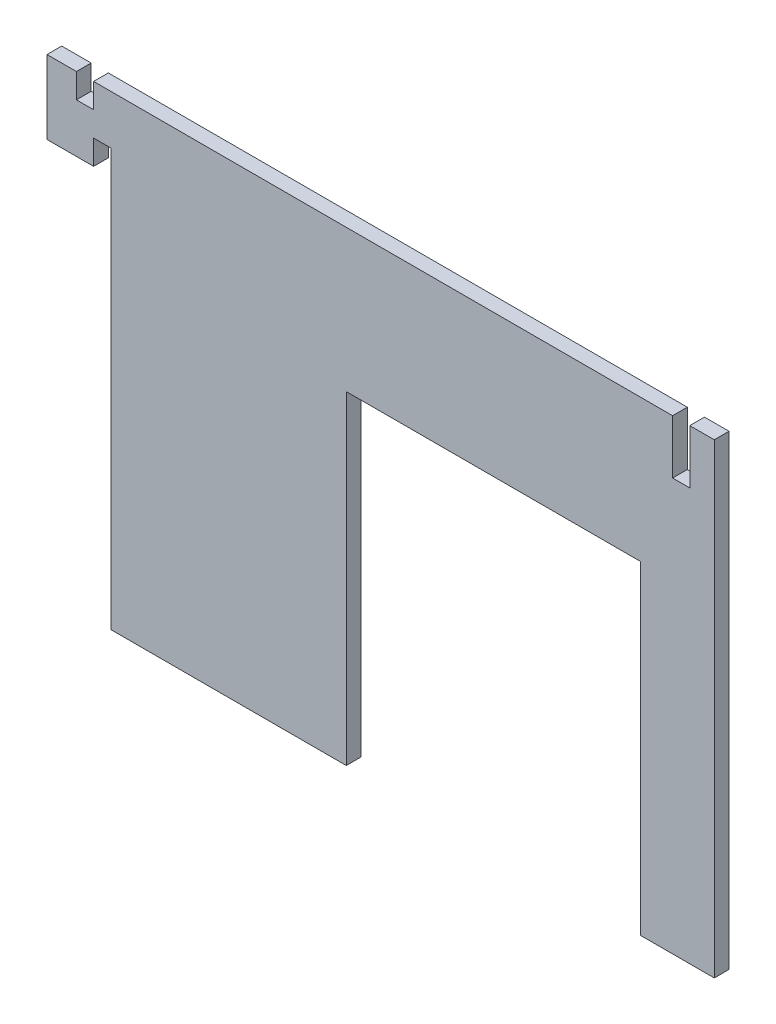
from build123d import *

# Parameters (mm, degrees)
ESQUISSE1_W             = 136
ESQUISSE1_H             = 95
EXTRUSION1_DEPTH        = 3
ESQUISSE2_W             = 13
ESQUISSE2_H             = 80
ENL_V_MAT_EXTRU_2_DEPTH = 3
ESQUISSE4_W             = 60
ESQUISSE4_H             = 66
ENL_V_MAT_EXTRU_3_DEPTH = 3
ESQUISSE5_W             = 3.5
ESQUISSE5_H             = 5
ENL_V_MAT_EXTRU_4_DEPTH = 3
ESQUISSE6_W             = 3.5
ESQUISSE6_H             = 5
ENL_V_MAT_EXTRU_5_DEPTH = 3
ESQUISSE7_W             = 3.5
ESQUISSE7_H             = 11
ENL_V_MAT_EXTRU_6_DEPTH = 3


with BuildPart() as part:
    # Esquisse1 → Extrusion1 (new body)
    with BuildSketch(Plane.XY):
        with Locations((68, 47.5)):
            Rectangle(ESQUISSE1_W, ESQUISSE1_H)
    extrude(amount=EXTRUSION1_DEPTH)

    # Esquisse2 → Enl_v. mat.-Extru.2 (cut)
    with BuildSketch(Plane.XY.offset(3)):
        with Locations((6.5, 40)):
            Rectangle(ESQUISSE2_W, ESQUISSE2_H)
    extrude(amount=-ENL_V_MAT_EXTRU_2_DEPTH, mode=Mode.SUBTRACT)

    # Esquisse4 → Enl_v. mat.-Extru.3 (cut)
    with BuildSketch(Plane.XY.offset(3)):
        with Locations((91, 33)):
            Rectangle(ESQUISSE4_W, ESQUISSE4_H)
    extrude(amount=-ENL_V_MAT_EXTRU_3_DEPTH, mode=Mode.SUBTRACT)

    # Esquisse5 → Enl_v. mat.-Extru.4 (cut)
    with BuildSketch(Plane.XY.offset(3)):
        with Locations((7.75, 92.5)):
            Rectangle(ESQUISSE5_W, ESQUISSE5_H)
    extrude(amount=-ENL_V_MAT_EXTRU_4_DEPTH, mode=Mode.SUBTRACT)

    # Esquisse6 → Enl_v. mat.-Extru.5 (cut)
    with BuildSketch(Plane.XY.offset(3)):
        with Locations((11.25, 82.5)):
            Rectangle(ESQUISSE6_W, ESQUISSE6_H)
    extrude(amount=-ENL_V_MAT_EXTRU_5_DEPTH, mode=Mode.SUBTRACT)

    # Esquisse7 → Enl_v. mat.-Extru.6 (cut)
    with BuildSketch(Plane.XY.offset(3)):
        with Locations((129.25, 89.5)):
            Rectangle(ESQUISSE7_W, ESQUISSE7_H)
    extrude(amount=-ENL_V_MAT_EXTRU_6_DEPTH, mode=Mode.SUBTRACT)


solid = part.part
